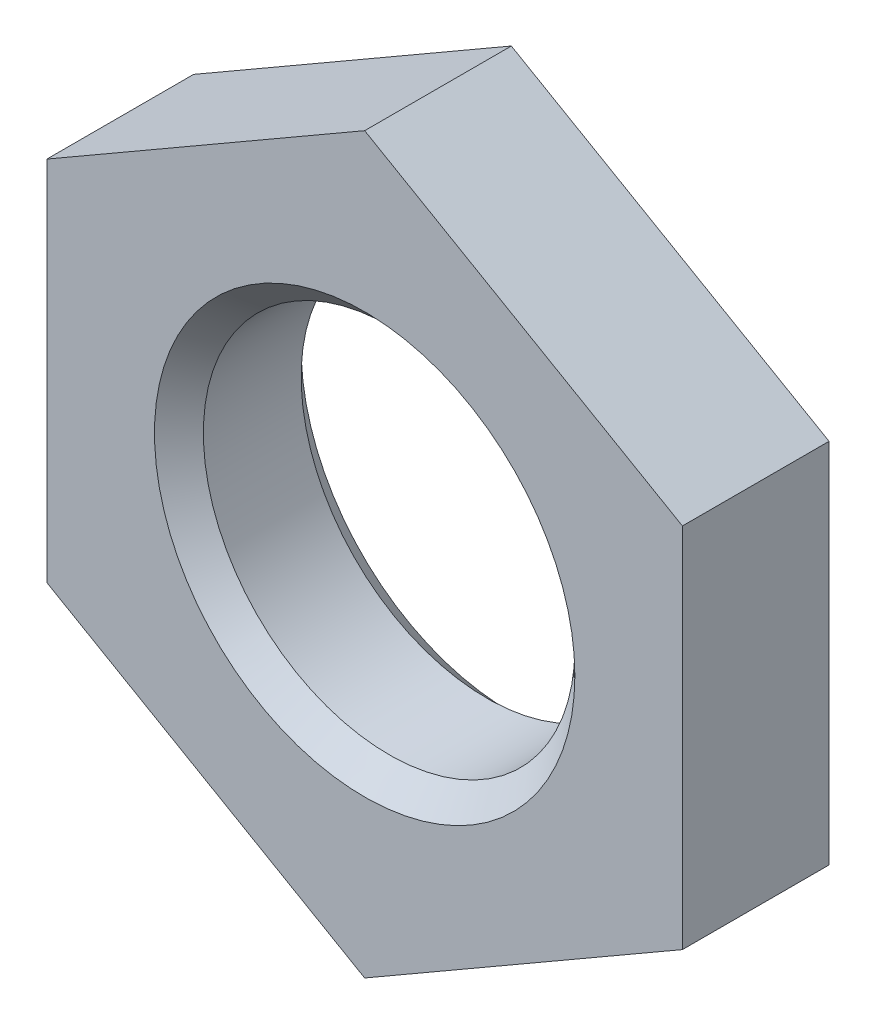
ISO-10303-21;
HEADER;
FILE_DESCRIPTION(('STEP AP214'),'2;1');
FILE_NAME('part.step','',(''),(''),'','','');
FILE_SCHEMA(('AUTOMOTIVE_DESIGN { 1 0 10303 214 1 1 1 1 }'));
ENDSEC;
DATA;
#1=APPLICATION_CONTEXT('core data for automotive mechanical design processes');
#2=APPLICATION_PROTOCOL_DEFINITION('international standard','automotive_design',2000,#1);
#3=PRODUCT_CONTEXT('',#1,'mechanical');
#4=PRODUCT('Part','Part','',(#3));
#5=PRODUCT_RELATED_PRODUCT_CATEGORY('part','',(#4));
#6=PRODUCT_DEFINITION_FORMATION('','',#4);
#7=PRODUCT_DEFINITION_CONTEXT('part definition',#1,'design');
#8=PRODUCT_DEFINITION('design','',#6,#7);
#9=PRODUCT_DEFINITION_SHAPE('','',#8);
#10=(LENGTH_UNIT() NAMED_UNIT(*) SI_UNIT(.MILLI.,.METRE.));
#11=(NAMED_UNIT(*) PLANE_ANGLE_UNIT() SI_UNIT($,.RADIAN.));
#12=(NAMED_UNIT(*) SI_UNIT($,.STERADIAN.) SOLID_ANGLE_UNIT());
#13=UNCERTAINTY_MEASURE_WITH_UNIT(LENGTH_MEASURE(1.E-05),#10,'distance_accuracy_value','');
#14=(GEOMETRIC_REPRESENTATION_CONTEXT(3) GLOBAL_UNCERTAINTY_ASSIGNED_CONTEXT((#13)) GLOBAL_UNIT_ASSIGNED_CONTEXT((#10,
#11,#12)) REPRESENTATION_CONTEXT('',''));
#15=CARTESIAN_POINT('',(0.,0.,0.));
#16=DIRECTION('',(0.,0.,1.));
#17=DIRECTION('',(1.,0.,0.));
#18=AXIS2_PLACEMENT_3D('',#15,#16,#17);
#19=CARTESIAN_POINT('',(6.49999999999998,3.75277674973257,3.));
#20=DIRECTION('',(-0.5,-0.866025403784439,0.));
#21=DIRECTION('',(0.866025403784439,-0.5,0.));
#22=AXIS2_PLACEMENT_3D('',#19,#20,#21);
#23=PLANE('',#22);
#24=DIRECTION('',(-0.866025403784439,0.5,0.));
#25=VECTOR('',#24,1.);
#26=CARTESIAN_POINT('',(6.49999999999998,3.75277674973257,0.));
#27=LINE('',#26,#25);
#28=CARTESIAN_POINT('',(6.49999999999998,3.75277674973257,0.));
#29=VERTEX_POINT('',#28);
#30=CARTESIAN_POINT('',(0.,7.50555349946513,0.));
#31=VERTEX_POINT('',#30);
#32=EDGE_CURVE('E117',#29,#31,#27,.T.);
#33=ORIENTED_EDGE('',*,*,#32,.T.);
#34=DIRECTION('',(0.,0.,-1.));
#35=VECTOR('',#34,1.);
#36=CARTESIAN_POINT('',(0.,7.50555349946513,3.));
#37=LINE('',#36,#35);
#38=CARTESIAN_POINT('',(0.,7.50555349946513,3.));
#39=VERTEX_POINT('',#38);
#40=EDGE_CURVE('E134',#39,#31,#37,.T.);
#41=ORIENTED_EDGE('',*,*,#40,.F.);
#42=DIRECTION('',(-0.866025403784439,0.5,0.));
#43=VECTOR('',#42,1.);
#44=CARTESIAN_POINT('',(6.49999999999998,3.75277674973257,3.));
#45=LINE('',#44,#43);
#46=CARTESIAN_POINT('',(6.49999999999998,3.75277674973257,3.));
#47=VERTEX_POINT('',#46);
#48=EDGE_CURVE('E127',#47,#39,#45,.T.);
#49=ORIENTED_EDGE('',*,*,#48,.F.);
#50=DIRECTION('',(0.,0.,-1.));
#51=VECTOR('',#50,1.);
#52=CARTESIAN_POINT('',(6.49999999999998,3.75277674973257,3.));
#53=LINE('',#52,#51);
#54=EDGE_CURVE('E113',#47,#29,#53,.T.);
#55=ORIENTED_EDGE('',*,*,#54,.T.);
#56=EDGE_LOOP('',(#33,#41,#49,#55));
#57=FACE_BOUND('',#56,.T.);
#58=ADVANCED_FACE('F31',(#57),#23,.F.);
#59=CARTESIAN_POINT('',(0.,7.50555349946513,3.));
#60=DIRECTION('',(0.500000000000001,-0.866025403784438,0.));
#61=DIRECTION('',(0.866025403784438,0.500000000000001,0.));
#62=AXIS2_PLACEMENT_3D('',#59,#60,#61);
#63=PLANE('',#62);
#64=DIRECTION('',(-0.866025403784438,-0.500000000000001,0.));
#65=VECTOR('',#64,1.);
#66=CARTESIAN_POINT('',(0.,7.50555349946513,0.));
#67=LINE('',#66,#65);
#68=CARTESIAN_POINT('',(-6.49999999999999,3.75277674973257,0.));
#69=VERTEX_POINT('',#68);
#70=EDGE_CURVE('E120',#31,#69,#67,.T.);
#71=ORIENTED_EDGE('',*,*,#70,.T.);
#72=DIRECTION('',(0.,0.,-1.));
#73=VECTOR('',#72,1.);
#74=CARTESIAN_POINT('',(-6.49999999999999,3.75277674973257,3.));
#75=LINE('',#74,#73);
#76=CARTESIAN_POINT('',(-6.49999999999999,3.75277674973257,3.));
#77=VERTEX_POINT('',#76);
#78=EDGE_CURVE('E131',#77,#69,#75,.T.);
#79=ORIENTED_EDGE('',*,*,#78,.F.);
#80=DIRECTION('',(-0.866025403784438,-0.500000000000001,0.));
#81=VECTOR('',#80,1.);
#82=CARTESIAN_POINT('',(0.,7.50555349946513,3.));
#83=LINE('',#82,#81);
#84=EDGE_CURVE('E86',#39,#77,#83,.T.);
#85=ORIENTED_EDGE('',*,*,#84,.F.);
#86=ORIENTED_EDGE('',*,*,#40,.T.);
#87=EDGE_LOOP('',(#71,#79,#85,#86));
#88=FACE_BOUND('',#87,.T.);
#89=ADVANCED_FACE('F179',(#88),#63,.F.);
#90=CARTESIAN_POINT('',(-6.49999999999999,3.75277674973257,3.));
#91=DIRECTION('',(1.,0.,0.));
#92=DIRECTION('',(0.,1.,0.));
#93=AXIS2_PLACEMENT_3D('',#90,#91,#92);
#94=PLANE('',#93);
#95=DIRECTION('',(0.,-1.,0.));
#96=VECTOR('',#95,1.);
#97=CARTESIAN_POINT('',(-6.49999999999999,3.75277674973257,0.));
#98=LINE('',#97,#96);
#99=CARTESIAN_POINT('',(-6.49999999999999,-3.75277674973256,0.));
#100=VERTEX_POINT('',#99);
#101=EDGE_CURVE('E122',#69,#100,#98,.T.);
#102=ORIENTED_EDGE('',*,*,#101,.T.);
#103=DIRECTION('',(0.,0.,-1.));
#104=VECTOR('',#103,1.);
#105=CARTESIAN_POINT('',(-6.49999999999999,-3.75277674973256,3.));
#106=LINE('',#105,#104);
#107=CARTESIAN_POINT('',(-6.49999999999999,-3.75277674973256,3.));
#108=VERTEX_POINT('',#107);
#109=EDGE_CURVE('E108',#108,#100,#106,.T.);
#110=ORIENTED_EDGE('',*,*,#109,.F.);
#111=DIRECTION('',(0.,-1.,0.));
#112=VECTOR('',#111,1.);
#113=CARTESIAN_POINT('',(-6.49999999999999,3.75277674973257,3.));
#114=LINE('',#113,#112);
#115=EDGE_CURVE('E99',#77,#108,#114,.T.);
#116=ORIENTED_EDGE('',*,*,#115,.F.);
#117=ORIENTED_EDGE('',*,*,#78,.T.);
#118=EDGE_LOOP('',(#102,#110,#116,#117));
#119=FACE_BOUND('',#118,.T.);
#120=ADVANCED_FACE('F184',(#119),#94,.F.);
#121=CARTESIAN_POINT('',(-6.49999999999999,-3.75277674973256,3.));
#122=DIRECTION('',(0.5,0.866025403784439,0.));
#123=DIRECTION('',(-0.866025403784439,0.5,0.));
#124=AXIS2_PLACEMENT_3D('',#121,#122,#123);
#125=PLANE('',#124);
#126=DIRECTION('',(0.866025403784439,-0.5,0.));
#127=VECTOR('',#126,1.);
#128=CARTESIAN_POINT('',(-6.49999999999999,-3.75277674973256,0.));
#129=LINE('',#128,#127);
#130=CARTESIAN_POINT('',(0.,-7.50555349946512,0.));
#131=VERTEX_POINT('',#130);
#132=EDGE_CURVE('E107',#100,#131,#129,.T.);
#133=ORIENTED_EDGE('',*,*,#132,.T.);
#134=DIRECTION('',(0.,0.,-1.));
#135=VECTOR('',#134,1.);
#136=CARTESIAN_POINT('',(0.,-7.50555349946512,3.));
#137=LINE('',#136,#135);
#138=CARTESIAN_POINT('',(0.,-7.50555349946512,3.));
#139=VERTEX_POINT('',#138);
#140=EDGE_CURVE('E104',#139,#131,#137,.T.);
#141=ORIENTED_EDGE('',*,*,#140,.F.);
#142=DIRECTION('',(0.866025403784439,-0.5,0.));
#143=VECTOR('',#142,1.);
#144=CARTESIAN_POINT('',(-6.49999999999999,-3.75277674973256,3.));
#145=LINE('',#144,#143);
#146=EDGE_CURVE('E93',#108,#139,#145,.T.);
#147=ORIENTED_EDGE('',*,*,#146,.F.);
#148=ORIENTED_EDGE('',*,*,#109,.T.);
#149=EDGE_LOOP('',(#133,#141,#147,#148));
#150=FACE_BOUND('',#149,.T.);
#151=ADVANCED_FACE('F105',(#150),#125,.F.);
#152=CARTESIAN_POINT('',(0.,-7.50555349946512,3.));
#153=DIRECTION('',(-0.5,0.866025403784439,0.));
#154=DIRECTION('',(-0.866025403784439,-0.5,0.));
#155=AXIS2_PLACEMENT_3D('',#152,#153,#154);
#156=PLANE('',#155);
#157=DIRECTION('',(0.866025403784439,0.5,0.));
#158=VECTOR('',#157,1.);
#159=CARTESIAN_POINT('',(0.,-7.50555349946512,0.));
#160=LINE('',#159,#158);
#161=CARTESIAN_POINT('',(6.49999999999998,-3.75277674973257,0.));
#162=VERTEX_POINT('',#161);
#163=EDGE_CURVE('E71',#131,#162,#160,.T.);
#164=ORIENTED_EDGE('',*,*,#163,.T.);
#165=DIRECTION('',(0.,0.,-1.));
#166=VECTOR('',#165,1.);
#167=CARTESIAN_POINT('',(6.49999999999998,-3.75277674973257,3.));
#168=LINE('',#167,#166);
#169=CARTESIAN_POINT('',(6.49999999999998,-3.75277674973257,3.));
#170=VERTEX_POINT('',#169);
#171=EDGE_CURVE('E109',#170,#162,#168,.T.);
#172=ORIENTED_EDGE('',*,*,#171,.F.);
#173=DIRECTION('',(0.866025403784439,0.5,0.));
#174=VECTOR('',#173,1.);
#175=CARTESIAN_POINT('',(0.,-7.50555349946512,3.));
#176=LINE('',#175,#174);
#177=EDGE_CURVE('E97',#139,#170,#176,.T.);
#178=ORIENTED_EDGE('',*,*,#177,.F.);
#179=ORIENTED_EDGE('',*,*,#140,.T.);
#180=EDGE_LOOP('',(#164,#172,#178,#179));
#181=FACE_BOUND('',#180,.T.);
#182=ADVANCED_FACE('F111',(#181),#156,.F.);
#183=CARTESIAN_POINT('',(6.49999999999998,-3.75277674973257,3.));
#184=DIRECTION('',(-1.,0.,0.));
#185=DIRECTION('',(0.,0.,1.));
#186=AXIS2_PLACEMENT_3D('',#183,#184,#185);
#187=PLANE('',#186);
#188=DIRECTION('',(0.,1.,0.));
#189=VECTOR('',#188,1.);
#190=CARTESIAN_POINT('',(6.49999999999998,-3.75277674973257,0.));
#191=LINE('',#190,#189);
#192=EDGE_CURVE('E77',#162,#29,#191,.T.);
#193=ORIENTED_EDGE('',*,*,#192,.T.);
#194=ORIENTED_EDGE('',*,*,#54,.F.);
#195=DIRECTION('',(0.,1.,0.));
#196=VECTOR('',#195,1.);
#197=CARTESIAN_POINT('',(6.49999999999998,-3.75277674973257,3.));
#198=LINE('',#197,#196);
#199=EDGE_CURVE('E48',#170,#47,#198,.T.);
#200=ORIENTED_EDGE('',*,*,#199,.F.);
#201=ORIENTED_EDGE('',*,*,#171,.T.);
#202=EDGE_LOOP('',(#193,#194,#200,#201));
#203=FACE_BOUND('',#202,.T.);
#204=ADVANCED_FACE('F169',(#203),#187,.F.);
#205=CARTESIAN_POINT('',(-6.49999999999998,11.2583302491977,3.));
#206=DIRECTION('',(0.,0.,1.));
#207=DIRECTION('',(1.,0.,0.));
#208=AXIS2_PLACEMENT_3D('',#205,#206,#207);
#209=PLANE('',#208);
#210=CARTESIAN_POINT('',(0.,-0.000553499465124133,3.));
#211=DIRECTION('',(0.,0.,1.));
#212=DIRECTION('',(1.,0.,0.));
#213=AXIS2_PLACEMENT_3D('',#210,#211,#212);
#214=CIRCLE('',#213,4.3);
#215=CARTESIAN_POINT('',(4.30000000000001,-0.000553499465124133,3.));
#216=VERTEX_POINT('',#215);
#217=EDGE_CURVE('E40',#216,#216,#214,.F.);
#218=ORIENTED_EDGE('',*,*,#217,.T.);
#219=EDGE_LOOP('',(#218));
#220=FACE_BOUND('',#219,.T.);
#221=ORIENTED_EDGE('',*,*,#48,.T.);
#222=ORIENTED_EDGE('',*,*,#84,.T.);
#223=ORIENTED_EDGE('',*,*,#115,.T.);
#224=ORIENTED_EDGE('',*,*,#146,.T.);
#225=ORIENTED_EDGE('',*,*,#177,.T.);
#226=ORIENTED_EDGE('',*,*,#199,.T.);
#227=EDGE_LOOP('',(#221,#222,#223,#224,#225,#226));
#228=FACE_BOUND('',#227,.T.);
#229=ADVANCED_FACE('F95',(#220,#228),#209,.T.);
#230=CARTESIAN_POINT('',(-6.49999999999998,11.2583302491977,0.));
#231=DIRECTION('',(0.,0.,1.));
#232=DIRECTION('',(1.,0.,0.));
#233=AXIS2_PLACEMENT_3D('',#230,#231,#232);
#234=PLANE('',#233);
#235=CARTESIAN_POINT('',(0.,-0.000553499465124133,0.));
#236=DIRECTION('',(0.,0.,1.));
#237=DIRECTION('',(1.,0.,0.));
#238=AXIS2_PLACEMENT_3D('',#235,#236,#237);
#239=CIRCLE('',#238,4.3);
#240=CARTESIAN_POINT('',(4.30000000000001,-0.000553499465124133,0.));
#241=VERTEX_POINT('',#240);
#242=EDGE_CURVE('E11',#241,#241,#239,.T.);
#243=ORIENTED_EDGE('',*,*,#242,.T.);
#244=EDGE_LOOP('',(#243));
#245=FACE_BOUND('',#244,.T.);
#246=ORIENTED_EDGE('',*,*,#32,.F.);
#247=ORIENTED_EDGE('',*,*,#192,.F.);
#248=ORIENTED_EDGE('',*,*,#163,.F.);
#249=ORIENTED_EDGE('',*,*,#132,.F.);
#250=ORIENTED_EDGE('',*,*,#101,.F.);
#251=ORIENTED_EDGE('',*,*,#70,.F.);
#252=EDGE_LOOP('',(#246,#247,#248,#249,#250,#251));
#253=FACE_BOUND('',#252,.T.);
#254=ADVANCED_FACE('F153',(#245,#253),#234,.F.);
#255=CARTESIAN_POINT('',(0.,-0.000553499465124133,3.));
#256=DIRECTION('',(0.,0.,1.));
#257=DIRECTION('',(1.,0.,0.));
#258=AXIS2_PLACEMENT_3D('',#255,#256,#257);
#259=CYLINDRICAL_SURFACE('',#258,3.8);
#260=CARTESIAN_POINT('',(0.,-0.000553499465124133,2.5));
#261=DIRECTION('',(0.,0.,1.));
#262=DIRECTION('',(1.,0.,0.));
#263=AXIS2_PLACEMENT_3D('',#260,#261,#262);
#264=CIRCLE('',#263,3.8);
#265=CARTESIAN_POINT('',(3.80000000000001,-0.000553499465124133,2.5));
#266=VERTEX_POINT('',#265);
#267=EDGE_CURVE('E139',#266,#266,#264,.T.);
#268=ORIENTED_EDGE('',*,*,#267,.T.);
#269=EDGE_LOOP('',(#268));
#270=FACE_BOUND('',#269,.T.);
#271=CARTESIAN_POINT('',(0.,-0.000553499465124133,0.500000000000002));
#272=DIRECTION('',(0.,0.,1.));
#273=DIRECTION('',(1.,0.,0.));
#274=AXIS2_PLACEMENT_3D('',#271,#272,#273);
#275=CIRCLE('',#274,3.8);
#276=CARTESIAN_POINT('',(3.80000000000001,-0.000553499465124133,0.500000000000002));
#277=VERTEX_POINT('',#276);
#278=EDGE_CURVE('E136',#277,#277,#275,.F.);
#279=ORIENTED_EDGE('',*,*,#278,.T.);
#280=EDGE_LOOP('',(#279));
#281=FACE_BOUND('',#280,.T.);
#282=ADVANCED_FACE('F148',(#270,#281),#259,.F.);
#283=CARTESIAN_POINT('',(0.,-0.000553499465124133,2.5));
#284=DIRECTION('',(0.,0.,1.));
#285=DIRECTION('',(1.,0.,0.));
#286=AXIS2_PLACEMENT_3D('',#283,#284,#285);
#287=CONICAL_SURFACE('',#286,3.8,0.785398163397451);
#288=ORIENTED_EDGE('',*,*,#217,.F.);
#289=EDGE_LOOP('',(#288));
#290=FACE_BOUND('',#289,.T.);
#291=ORIENTED_EDGE('',*,*,#267,.F.);
#292=EDGE_LOOP('',(#291));
#293=FACE_BOUND('',#292,.T.);
#294=ADVANCED_FACE('F145',(#290,#293),#287,.F.);
#295=CARTESIAN_POINT('',(0.,-0.000553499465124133,0.));
#296=DIRECTION('',(0.,0.,-1.));
#297=DIRECTION('',(-1.,0.,0.));
#298=AXIS2_PLACEMENT_3D('',#295,#296,#297);
#299=CONICAL_SURFACE('',#298,4.3,0.785398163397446);
#300=ORIENTED_EDGE('',*,*,#278,.F.);
#301=EDGE_LOOP('',(#300));
#302=FACE_BOUND('',#301,.T.);
#303=ORIENTED_EDGE('',*,*,#242,.F.);
#304=EDGE_LOOP('',(#303));
#305=FACE_BOUND('',#304,.T.);
#306=ADVANCED_FACE('F33',(#302,#305),#299,.F.);
#307=CLOSED_SHELL('',(#58,#89,#120,#151,#182,#204,#229,#254,#282,#294,#306));
#308=MANIFOLD_SOLID_BREP('B2',#307);
#309=ADVANCED_BREP_SHAPE_REPRESENTATION('',(#18,#308),#14);
#310=SHAPE_DEFINITION_REPRESENTATION(#9,#309);
ENDSEC;
END-ISO-10303-21;
